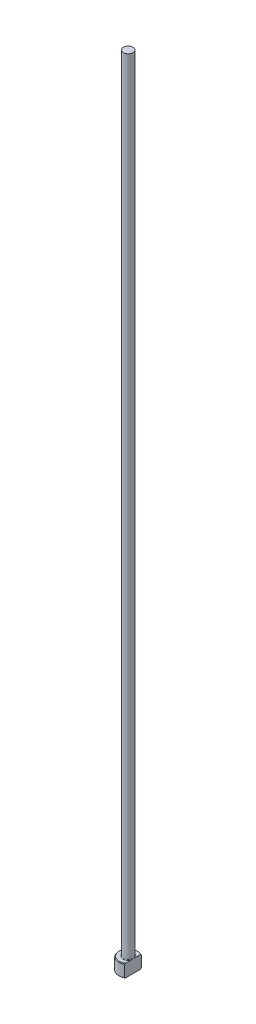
from build123d import *
from build123d.topology import SkipClean

# Parameters (mm, degrees)
CHAMFER1_SIZE    = 0.2
FILLET1_R        = 0.2
KEYED_HEAD_DEPTH = 251.035997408


with BuildPart() as part:
    # Sketch1 → Revolve1 (revolve)
    with BuildSketch(Plane.XY, mode=Mode.PRIVATE) as revolve1_sk:
        Polygon((0, 0), (-3, 0), (-3, 4), (-1.5, 4), (-1.5, 250), (0, 250), align=None)
    revolve(revolve1_sk.sketch.rotate(Axis((0, 259.958771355, 0), (0, -1, 0)), 270), axis=Axis((0, 259.958771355, 0), (0, -1, 0)))

    # Chamfer1
    chamfer1_edges = [part.edges().sort_by_distance(p)[0] for p in [
        (0, 4, -3),
        (0, 0, -3),
    ]]
    chamfer(chamfer1_edges, length=CHAMFER1_SIZE)

    # Fillet1
    fillet1_edges = [part.edges().sort_by_distance(p)[0] for p in [
        (0, 4, -1.5),
    ]]
    fillet(fillet1_edges, radius=FILLET1_R)

    # Sketch2 → KEYED HEAD (cut, through all)
    with SkipClean():  # the faces are left unmerged after this step: merging them gives an invalid solid
        with BuildSketch(Plane(origin=(0, 0, 0), x_dir=(1, 0, 0), z_dir=(0, 1, 0))):
            with BuildLine():
                Line((1.5, -2.598076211), (1.5, 2.598076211))
                ThreePointArc((1.5, 2.598076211), (3, 0), (1.5, -2.598076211))
            make_face()
        extrude(amount=KEYED_HEAD_DEPTH, mode=Mode.SUBTRACT)


solid = part.part
